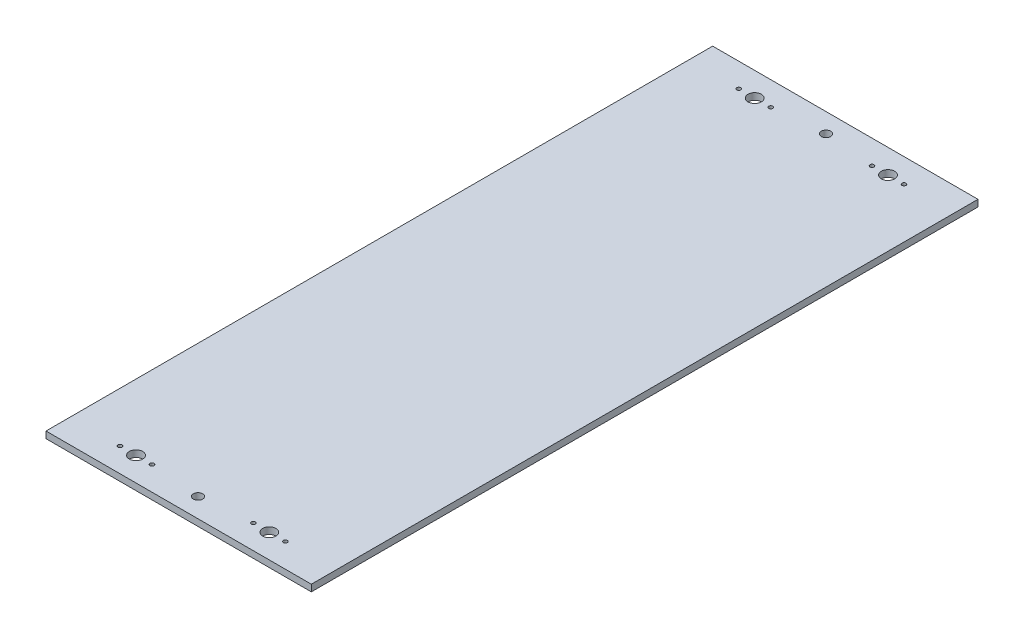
from build123d import *

# Parameters (mm, degrees)
SKETCH_2_W          = 398
SKETCH_2_H          = 1000
EXTRUDE_1_DEPTH     = 10
SKETCH_3_R          = 10
SKETCH_3_R_2        = 7
SKETCH_3_R_3        = 3
CUT_EXTRUDE_1_DEPTH = 10


with BuildPart() as part:
    # Sketch 2 → Extrude 1 (new body)
    with BuildSketch(Plane(origin=(0, 0, 0), x_dir=(1, 0, 0), z_dir=(0, 1, 0))):
        Rectangle(SKETCH_2_W, SKETCH_2_H)
    extrude(amount=EXTRUDE_1_DEPTH)

    # Sketch 3 (on Top Plane) → Cut-Extrude 1 (cut)
    with BuildSketch(Plane(origin=(0, 0, 0), x_dir=(1, 0, 0), z_dir=(0, 1, 0))):
        with Locations(Location((-100, 464, 0), (0, 0, 270))):
            Circle(SKETCH_3_R)
        with Locations(Location((100, 464, 0), (0, 0, 270))):
            Circle(SKETCH_3_R)
        with Locations(Location((0, 471, 0), (0, 0, 270))):
            Circle(SKETCH_3_R_2)
        with Locations(Location((-124, 464, 0), (0, 0, 270))):
            Circle(SKETCH_3_R_3)
        with Locations(Location((-76, 464, 0), (0, 0, 270))):
            Circle(SKETCH_3_R_3)
        with Locations(Location((76, 464, 0), (0, 0, 270))):
            Circle(SKETCH_3_R_3)
        with Locations(Location((124, 464, 0), (0, 0, 270))):
            Circle(SKETCH_3_R_3)
        with Locations(Location((124, -464, 0), (0, 0, 90))):
            Circle(SKETCH_3_R_3)
        with Locations(Location((76, -464, 0), (0, 0, 90))):
            Circle(SKETCH_3_R_3)
        with Locations(Location((-76, -464, 0), (0, 0, 90))):
            Circle(SKETCH_3_R_3)
        with Locations(Location((-124, -464, 0), (0, 0, 90))):
            Circle(SKETCH_3_R_3)
        with Locations(Location((0, -471, 0), (0, 0, 90))):
            Circle(SKETCH_3_R_2)
        with Locations(Location((100, -464, 0), (0, 0, 90))):
            Circle(SKETCH_3_R)
        with Locations(Location((-100, -464, 0), (0, 0, 90))):
            Circle(SKETCH_3_R)
    extrude(amount=CUT_EXTRUDE_1_DEPTH, mode=Mode.SUBTRACT)


solid = part.part
